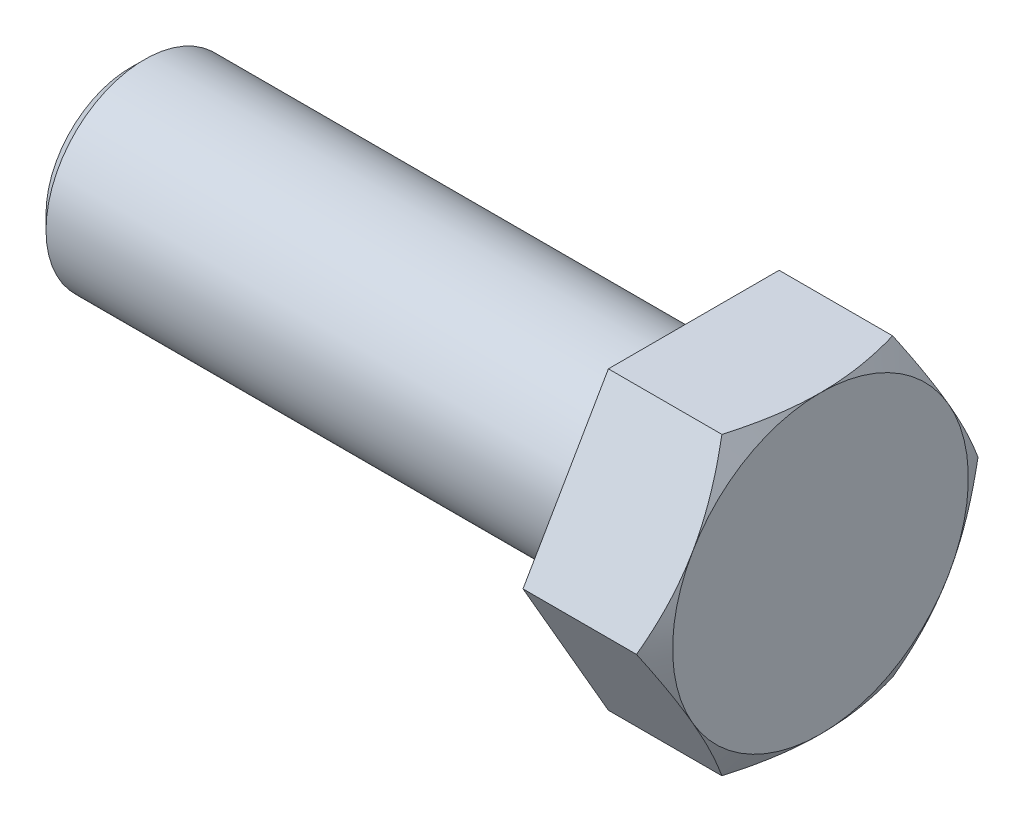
ISO-10303-21;
HEADER;
FILE_DESCRIPTION(('STEP AP214'),'2;1');
FILE_NAME('part.step','',(''),(''),'','','');
FILE_SCHEMA(('AUTOMOTIVE_DESIGN { 1 0 10303 214 1 1 1 1 }'));
ENDSEC;
DATA;
#1=APPLICATION_CONTEXT('core data for automotive mechanical design processes');
#2=APPLICATION_PROTOCOL_DEFINITION('international standard','automotive_design',2000,#1);
#3=PRODUCT_CONTEXT('',#1,'mechanical');
#4=PRODUCT('Part','Part','',(#3));
#5=PRODUCT_RELATED_PRODUCT_CATEGORY('part','',(#4));
#6=PRODUCT_DEFINITION_FORMATION('','',#4);
#7=PRODUCT_DEFINITION_CONTEXT('part definition',#1,'design');
#8=PRODUCT_DEFINITION('design','',#6,#7);
#9=PRODUCT_DEFINITION_SHAPE('','',#8);
#10=(LENGTH_UNIT() NAMED_UNIT(*) SI_UNIT(.MILLI.,.METRE.));
#11=(NAMED_UNIT(*) PLANE_ANGLE_UNIT() SI_UNIT($,.RADIAN.));
#12=(NAMED_UNIT(*) SI_UNIT($,.STERADIAN.) SOLID_ANGLE_UNIT());
#13=UNCERTAINTY_MEASURE_WITH_UNIT(LENGTH_MEASURE(1.E-05),#10,'distance_accuracy_value','');
#14=(GEOMETRIC_REPRESENTATION_CONTEXT(3) GLOBAL_UNCERTAINTY_ASSIGNED_CONTEXT((#13)) GLOBAL_UNIT_ASSIGNED_CONTEXT((#10,
#11,#12)) REPRESENTATION_CONTEXT('',''));
#15=CARTESIAN_POINT('',(0.,0.,0.));
#16=DIRECTION('',(0.,0.,1.));
#17=DIRECTION('',(1.,0.,0.));
#18=AXIS2_PLACEMENT_3D('',#15,#16,#17);
#19=CARTESIAN_POINT('',(0.,-21.,0.));
#20=DIRECTION('',(-1.,0.,0.));
#21=DIRECTION('',(0.,0.,1.));
#22=AXIS2_PLACEMENT_3D('',#19,#20,#21);
#23=PLANE('',#22);
#24=DIRECTION('',(0.,0.866025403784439,-0.499999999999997));
#25=VECTOR('',#24,1.);
#26=CARTESIAN_POINT('',(0.,-10.5,-6.06217782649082));
#27=LINE('',#26,#25);
#28=CARTESIAN_POINT('',(0.,-10.5,-6.06217782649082));
#29=VERTEX_POINT('',#28);
#30=CARTESIAN_POINT('',(0.,0.,-12.1243556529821));
#31=VERTEX_POINT('',#30);
#32=EDGE_CURVE('E207',#29,#31,#27,.T.);
#33=ORIENTED_EDGE('',*,*,#32,.F.);
#34=DIRECTION('',(0.,0.,-1.));
#35=VECTOR('',#34,1.);
#36=CARTESIAN_POINT('',(0.,-10.5,6.06217782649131));
#37=LINE('',#36,#35);
#38=CARTESIAN_POINT('',(0.,-10.5,6.06217782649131));
#39=VERTEX_POINT('',#38);
#40=EDGE_CURVE('E226',#39,#29,#37,.T.);
#41=ORIENTED_EDGE('',*,*,#40,.F.);
#42=DIRECTION('',(0.,-0.866025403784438,-0.500000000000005));
#43=VECTOR('',#42,1.);
#44=CARTESIAN_POINT('',(0.,-1.31838984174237E-13,12.1243556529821));
#45=LINE('',#44,#43);
#46=CARTESIAN_POINT('',(0.,-1.31838984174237E-13,12.1243556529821));
#47=VERTEX_POINT('',#46);
#48=EDGE_CURVE('E223',#47,#39,#45,.T.);
#49=ORIENTED_EDGE('',*,*,#48,.F.);
#50=DIRECTION('',(0.,-0.866025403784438,0.499999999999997));
#51=VECTOR('',#50,1.);
#52=CARTESIAN_POINT('',(0.,10.5,6.06217782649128));
#53=LINE('',#52,#51);
#54=CARTESIAN_POINT('',(0.,10.5,6.06217782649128));
#55=VERTEX_POINT('',#54);
#56=EDGE_CURVE('E221',#55,#47,#53,.T.);
#57=ORIENTED_EDGE('',*,*,#56,.F.);
#58=DIRECTION('',(0.,0.,1.));
#59=VECTOR('',#58,1.);
#60=CARTESIAN_POINT('',(0.,10.5,-6.06217782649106));
#61=LINE('',#60,#59);
#62=CARTESIAN_POINT('',(0.,10.5,-6.06217782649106));
#63=VERTEX_POINT('',#62);
#64=EDGE_CURVE('E218',#63,#55,#61,.T.);
#65=ORIENTED_EDGE('',*,*,#64,.F.);
#66=DIRECTION('',(0.,0.866025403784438,0.500000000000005));
#67=VECTOR('',#66,1.);
#68=CARTESIAN_POINT('',(0.,0.,-12.1243556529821));
#69=LINE('',#68,#67);
#70=EDGE_CURVE('E210',#31,#63,#69,.T.);
#71=ORIENTED_EDGE('',*,*,#70,.F.);
#72=EDGE_LOOP('',(#33,#41,#49,#57,#65,#71));
#73=FACE_BOUND('',#72,.T.);
#74=CARTESIAN_POINT('',(0.,0.,0.));
#75=DIRECTION('',(-1.,0.,0.));
#76=DIRECTION('',(0.,0.,1.));
#77=AXIS2_PLACEMENT_3D('',#74,#75,#76);
#78=CIRCLE('',#77,7.);
#79=CARTESIAN_POINT('',(0.,0.,7.));
#80=VERTEX_POINT('',#79);
#81=EDGE_CURVE('E205',#80,#80,#78,.T.);
#82=ORIENTED_EDGE('',*,*,#81,.F.);
#83=EDGE_LOOP('',(#82));
#84=FACE_BOUND('',#83,.T.);
#85=ADVANCED_FACE('F31',(#73,#84),#23,.T.);
#86=CARTESIAN_POINT('',(9.00000000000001,-10.5,-6.06217782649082));
#87=DIRECTION('',(0.,0.500000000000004,0.866025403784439));
#88=DIRECTION('',(0.,-0.866025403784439,0.499999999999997));
#89=AXIS2_PLACEMENT_3D('',#86,#87,#88);
#90=PLANE('',#89);
#91=DIRECTION('',(-1.,0.,0.));
#92=VECTOR('',#91,1.);
#93=CARTESIAN_POINT('',(8.99999999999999,0.,-12.1243556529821));
#94=LINE('',#93,#92);
#95=CARTESIAN_POINT('',(8.06217782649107,0.,-12.1243556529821));
#96=VERTEX_POINT('',#95);
#97=EDGE_CURVE('E125',#96,#31,#94,.T.);
#98=ORIENTED_EDGE('',*,*,#97,.F.);
#99=CARTESIAN_POINT('',(8.06211115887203,0.000199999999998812,-12.124471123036));
#100=CARTESIAN_POINT('',(8.13903608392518,-0.230612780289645,-11.9912113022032));
#101=CARTESIAN_POINT('',(8.2124696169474,-0.462286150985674,-11.8574546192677));
#102=CARTESIAN_POINT('',(8.3513851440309,-0.927490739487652,-11.5888686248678));
#103=CARTESIAN_POINT('',(8.41686452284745,-1.16102254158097,-11.4540389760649));
#104=CARTESIAN_POINT('',(8.60010423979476,-1.86538084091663,-11.0473775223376));
#105=CARTESIAN_POINT('',(8.70433004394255,-2.33898788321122,-10.7739403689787));
#106=CARTESIAN_POINT('',(8.82654435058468,-3.04771913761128,-10.3647541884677));
#107=CARTESIAN_POINT('',(8.8613585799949,-3.28072597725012,-10.2302276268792));
#108=CARTESIAN_POINT('',(8.91973973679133,-3.7478184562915,-9.96055165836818));
#109=CARTESIAN_POINT('',(8.94330644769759,-3.98190411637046,-9.82540223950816));
#110=CARTESIAN_POINT('',(8.97858873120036,-4.45046590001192,-9.55487796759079));
#111=CARTESIAN_POINT('',(8.99031838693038,-4.68494122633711,-9.41950357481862));
#112=CARTESIAN_POINT('',(9.00167731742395,-5.1541084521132,-9.14862975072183));
#113=CARTESIAN_POINT('',(9.00130696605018,-5.38880034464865,-9.01313032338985));
#114=CARTESIAN_POINT('',(8.98930773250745,-5.82756124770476,-8.75981159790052));
#115=CARTESIAN_POINT('',(8.97914260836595,-6.03166122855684,-8.64197441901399));
#116=CARTESIAN_POINT('',(8.94985839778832,-6.43938384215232,-8.40657565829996));
#117=CARTESIAN_POINT('',(8.93073867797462,-6.64300644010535,-8.28901409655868));
#118=CARTESIAN_POINT('',(8.86039965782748,-7.25308524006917,-7.93678493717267));
#119=CARTESIAN_POINT('',(8.79620926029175,-7.65846156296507,-7.70274080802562));
#120=CARTESIAN_POINT('',(8.63573291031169,-8.4735142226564,-7.23216993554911));
#121=CARTESIAN_POINT('',(8.53876673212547,-8.88308654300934,-6.99570324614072));
#122=CARTESIAN_POINT('',(8.31869386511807,-9.69612354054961,-6.52629611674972));
#123=CARTESIAN_POINT('',(8.19563886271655,-10.0995986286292,-6.29334966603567));
#124=CARTESIAN_POINT('',(8.06211115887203,-10.5002,-6.06206235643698));
#125=B_SPLINE_CURVE_WITH_KNOTS('',3,(#99,#100,#101,#102,#103,#104,#105,#106,#107,#108,#109,#110,
#111,#112,#113,#114,#115,#116,#117,#118,#119,#120,#121,#122,#123,#124),.UNSPECIFIED.,.F.,.F.,(4,
2,2,2,2,2,2,2,2,2,2,2,4),(0.,0.83213025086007,1.66453336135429,3.33288308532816,
4.14658222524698,4.96029702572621,5.77304256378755,6.58576298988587,7.2932670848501,
8.00082123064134,9.41693497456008,10.8644544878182,12.3091325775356),.UNSPECIFIED.);
#126=CARTESIAN_POINT('',(8.99999999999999,-5.25,-9.09326673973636));
#127=VERTEX_POINT('',#126);
#128=EDGE_CURVE('E139',#96,#127,#125,.T.);
#129=ORIENTED_EDGE('',*,*,#128,.T.);
#130=CARTESIAN_POINT('',(8.06217782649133,-10.5,-6.06217782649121));
#131=VERTEX_POINT('',#130);
#132=EDGE_CURVE('E147',#127,#131,#125,.T.);
#133=ORIENTED_EDGE('',*,*,#132,.T.);
#134=DIRECTION('',(-1.,0.,0.));
#135=VECTOR('',#134,1.);
#136=CARTESIAN_POINT('',(9.00000000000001,-10.5,-6.06217782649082));
#137=LINE('',#136,#135);
#138=EDGE_CURVE('E229',#131,#29,#137,.T.);
#139=ORIENTED_EDGE('',*,*,#138,.T.);
#140=ORIENTED_EDGE('',*,*,#32,.T.);
#141=EDGE_LOOP('',(#98,#129,#133,#139,#140));
#142=FACE_BOUND('',#141,.T.);
#143=ADVANCED_FACE('F33',(#142),#90,.F.);
#144=CARTESIAN_POINT('',(8.99999999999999,0.,-12.1243556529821));
#145=DIRECTION('',(0.,-0.499999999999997,0.866025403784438));
#146=DIRECTION('',(0.,-0.866025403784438,-0.500000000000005));
#147=AXIS2_PLACEMENT_3D('',#144,#145,#146);
#148=PLANE('',#147);
#149=DIRECTION('',(-1.,0.,0.));
#150=VECTOR('',#149,1.);
#151=CARTESIAN_POINT('',(9.00000000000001,10.5,-6.06217782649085));
#152=LINE('',#151,#150);
#153=CARTESIAN_POINT('',(8.06217782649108,10.5,-6.06217782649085));
#154=VERTEX_POINT('',#153);
#155=EDGE_CURVE('E236',#154,#63,#152,.T.);
#156=ORIENTED_EDGE('',*,*,#155,.F.);
#157=CARTESIAN_POINT('',(8.06211115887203,10.5002,-6.06206235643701));
#158=CARTESIAN_POINT('',(8.1390360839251,10.2693872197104,-6.19532217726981));
#159=CARTESIAN_POINT('',(8.21246961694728,10.0377138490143,-6.3290788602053));
#160=CARTESIAN_POINT('',(8.35138514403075,9.57250926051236,-6.59766485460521));
#161=CARTESIAN_POINT('',(8.41686452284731,9.33897745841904,-6.73249450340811));
#162=CARTESIAN_POINT('',(8.60010423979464,8.63461915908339,-7.13915595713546));
#163=CARTESIAN_POINT('',(8.70433004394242,8.16101211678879,-7.41259311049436));
#164=CARTESIAN_POINT('',(8.82654435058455,7.45228086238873,-7.82177929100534));
#165=CARTESIAN_POINT('',(8.86135857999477,7.21927402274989,-7.95630585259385));
#166=CARTESIAN_POINT('',(8.9197397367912,6.75218154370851,-8.22598182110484));
#167=CARTESIAN_POINT('',(8.94330644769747,6.51809588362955,-8.36113123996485));
#168=CARTESIAN_POINT('',(8.97858873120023,6.04953409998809,-8.63165551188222));
#169=CARTESIAN_POINT('',(8.99031838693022,5.81505877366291,-8.7670299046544));
#170=CARTESIAN_POINT('',(9.00167731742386,5.34589154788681,-9.03790372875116));
#171=CARTESIAN_POINT('',(9.00130696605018,5.11119965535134,-9.17340315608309));
#172=CARTESIAN_POINT('',(8.98930773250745,4.67243875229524,-9.42672188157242));
#173=CARTESIAN_POINT('',(8.97914260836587,4.46833877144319,-9.54455906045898));
#174=CARTESIAN_POINT('',(8.94985839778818,4.06061615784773,-9.77995782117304));
#175=CARTESIAN_POINT('',(8.93073867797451,3.85699355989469,-9.89751938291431));
#176=CARTESIAN_POINT('',(8.8603996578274,3.24691475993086,-10.2497485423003));
#177=CARTESIAN_POINT('',(8.79620926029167,2.84153843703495,-10.4837926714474));
#178=CARTESIAN_POINT('',(8.6357329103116,2.02648577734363,-10.9543635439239));
#179=CARTESIAN_POINT('',(8.53876673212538,1.61691345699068,-11.1908302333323));
#180=CARTESIAN_POINT('',(8.318693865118,0.803876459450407,-11.6602373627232));
#181=CARTESIAN_POINT('',(8.19563886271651,0.400401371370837,-11.8931838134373));
#182=CARTESIAN_POINT('',(8.06211115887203,-0.000199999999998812,-12.124471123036));
#183=B_SPLINE_CURVE_WITH_KNOTS('',3,(#157,#158,#159,#160,#161,#162,#163,#164,#165,#166,#167,
#168,#169,#170,#171,#172,#173,#174,#175,#176,#177,#178,#179,#180,#181,#182),.UNSPECIFIED.,.F.,
.F.,(4,2,2,2,2,2,2,2,2,2,2,2,4),(0.,0.832130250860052,1.66453336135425,3.33288308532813,
4.14658222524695,4.96029702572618,5.77304256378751,6.58576298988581,7.29326708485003,
8.00082123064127,9.41693497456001,10.8644544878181,12.3091325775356),.UNSPECIFIED.);
#184=CARTESIAN_POINT('',(8.99999999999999,5.24999999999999,-9.09326673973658));
#185=VERTEX_POINT('',#184);
#186=EDGE_CURVE('E114',#154,#185,#183,.T.);
#187=ORIENTED_EDGE('',*,*,#186,.T.);
#188=EDGE_CURVE('E136',#185,#96,#183,.T.);
#189=ORIENTED_EDGE('',*,*,#188,.T.);
#190=ORIENTED_EDGE('',*,*,#97,.T.);
#191=ORIENTED_EDGE('',*,*,#70,.T.);
#192=EDGE_LOOP('',(#156,#187,#189,#190,#191));
#193=FACE_BOUND('',#192,.T.);
#194=ADVANCED_FACE('F251',(#193),#148,.F.);
#195=CARTESIAN_POINT('',(9.00000000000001,10.5,-6.06217782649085));
#196=DIRECTION('',(0.,-1.,0.));
#197=DIRECTION('',(0.,0.,-1.));
#198=AXIS2_PLACEMENT_3D('',#195,#196,#197);
#199=PLANE('',#198);
#200=DIRECTION('',(-1.,0.,0.));
#201=VECTOR('',#200,1.);
#202=CARTESIAN_POINT('',(9.00000000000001,10.5,6.06217782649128));
#203=LINE('',#202,#201);
#204=CARTESIAN_POINT('',(8.06217782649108,10.5,6.06217782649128));
#205=VERTEX_POINT('',#204);
#206=EDGE_CURVE('E234',#205,#55,#203,.T.);
#207=ORIENTED_EDGE('',*,*,#206,.F.);
#208=CARTESIAN_POINT('',(3.73298832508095,10.5,-16.577141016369));
#209=CARTESIAN_POINT('',(3.8454556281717,10.5,-16.3465486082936));
#210=CARTESIAN_POINT('',(3.95738382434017,10.5,-16.1156933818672));
#211=CARTESIAN_POINT('',(4.18004043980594,10.5,-15.6534025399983));
#212=CARTESIAN_POINT('',(4.29076884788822,10.5,-15.4219669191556));
#213=CARTESIAN_POINT('',(4.62099940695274,10.5,-14.726649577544));
#214=CARTESIAN_POINT('',(4.83851565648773,10.5,-14.261821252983));
#215=CARTESIAN_POINT('',(5.2681001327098,10.5,-13.3267584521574));
#216=CARTESIAN_POINT('',(5.48013469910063,10.5,-12.8565084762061));
#217=CARTESIAN_POINT('',(5.89591157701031,10.5,-11.9123694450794));
#218=CARTESIAN_POINT('',(6.09965426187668,10.5,-11.438480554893));
#219=CARTESIAN_POINT('',(6.50344527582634,10.5,-10.4700424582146));
#220=CARTESIAN_POINT('',(6.70312941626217,10.5,-9.97534063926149));
#221=CARTESIAN_POINT('',(7.08808378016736,10.5,-8.98025556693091));
#222=CARTESIAN_POINT('',(7.27335242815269,10.5,-8.47987169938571));
#223=CARTESIAN_POINT('',(7.62482344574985,10.5,-7.47348695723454));
#224=CARTESIAN_POINT('',(7.79106198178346,10.5,-6.96749881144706));
#225=CARTESIAN_POINT('',(8.09934481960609,10.5,-5.94822415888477));
#226=CARTESIAN_POINT('',(8.24139643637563,10.5,-5.43493990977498));
#227=CARTESIAN_POINT('',(8.43095720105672,10.5,-4.66083446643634));
#228=CARTESIAN_POINT('',(8.49008926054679,10.5,-4.40284411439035));
#229=CARTESIAN_POINT('',(8.59983549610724,10.5,-3.88504864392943));
#230=CARTESIAN_POINT('',(8.65044983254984,10.5,-3.62524355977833));
#231=CARTESIAN_POINT('',(8.7422861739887,10.5,-3.10397753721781));
#232=CARTESIAN_POINT('',(8.78350843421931,10.5,-2.84251664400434));
#233=CARTESIAN_POINT('',(8.85575081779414,10.5,-2.31819032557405));
#234=CARTESIAN_POINT('',(8.88677136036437,10.5,-2.05532495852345));
#235=CARTESIAN_POINT('',(8.93758801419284,10.5,-1.53211676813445));
#236=CARTESIAN_POINT('',(8.95753116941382,10.5,-1.27178831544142));
#237=CARTESIAN_POINT('',(8.98637930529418,10.5,-0.750520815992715));
#238=CARTESIAN_POINT('',(8.99528447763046,10.5,-0.489581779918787));
#239=CARTESIAN_POINT('',(9.0018431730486,10.5,0.0324416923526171));
#240=CARTESIAN_POINT('',(8.99949663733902,10.5,0.293526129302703));
#241=CARTESIAN_POINT('',(8.98361221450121,10.5,0.8153569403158));
#242=CARTESIAN_POINT('',(8.97007383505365,10.5,1.07610329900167));
#243=CARTESIAN_POINT('',(8.92502503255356,10.5,1.69398340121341));
#244=CARTESIAN_POINT('',(8.88869314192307,10.5,2.05077383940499));
#245=CARTESIAN_POINT('',(8.79699113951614,10.5,2.76187995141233));
#246=CARTESIAN_POINT('',(8.74161868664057,10.5,3.11619531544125));
#247=CARTESIAN_POINT('',(8.5498626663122,10.5,4.17491630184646));
#248=CARTESIAN_POINT('',(8.38786884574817,10.5,4.8747545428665));
#249=CARTESIAN_POINT('',(8.10469551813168,10.5,5.92182124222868));
#250=CARTESIAN_POINT('',(8.00219294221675,10.5,6.27441462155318));
#251=CARTESIAN_POINT('',(7.78598095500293,10.5,6.97618242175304));
#252=CARTESIAN_POINT('',(7.6722714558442,10.5,7.32535681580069));
#253=CARTESIAN_POINT('',(7.43551618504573,10.4999999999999,8.02038997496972));
#254=CARTESIAN_POINT('',(7.31247296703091,10.4999999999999,8.36624961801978));
#255=CARTESIAN_POINT('',(7.05855378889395,10.5,9.05506244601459));
#256=CARTESIAN_POINT('',(6.92767801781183,10.5,9.39801570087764));
#257=CARTESIAN_POINT('',(6.56118489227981,10.5000000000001,10.3314786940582));
#258=CARTESIAN_POINT('',(6.3190292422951,10.5,10.9194191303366));
#259=CARTESIAN_POINT('',(5.8202069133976,10.4999999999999,12.0891351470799));
#260=CARTESIAN_POINT('',(5.5635385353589,10.4999999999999,12.6709099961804));
#261=CARTESIAN_POINT('',(5.03917038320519,10.4999999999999,13.8297328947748));
#262=CARTESIAN_POINT('',(4.77146619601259,10.4999999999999,14.4067789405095));
#263=CARTESIAN_POINT('',(4.22770202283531,10.4999999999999,15.5568762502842));
#264=CARTESIAN_POINT('',(3.95164239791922,10.4999999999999,16.1299276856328));
#265=CARTESIAN_POINT('',(3.39254290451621,10.4999999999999,17.2737919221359));
#266=CARTESIAN_POINT('',(3.10949216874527,10.4999999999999,17.8445994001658));
#267=CARTESIAN_POINT('',(2.53822148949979,10.4999999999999,18.9836236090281));
#268=CARTESIAN_POINT('',(2.2500015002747,10.4999999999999,19.551840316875));
#269=CARTESIAN_POINT('',(1.66948520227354,10.4999999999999,20.6860208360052));
#270=CARTESIAN_POINT('',(1.37718984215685,10.4999999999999,21.2519851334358));
#271=CARTESIAN_POINT('',(0.789230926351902,10.4999999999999,22.3821571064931));
#272=CARTESIAN_POINT('',(0.493567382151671,10.4999999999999,22.9463647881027));
#273=CARTESIAN_POINT('',(-0.333427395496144,10.4999999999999,24.5151536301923));
#274=CARTESIAN_POINT('',(-0.867767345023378,10.4999999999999,25.5181483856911));
#275=CARTESIAN_POINT('',(-1.94281169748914,10.4999999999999,27.5207974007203));
#276=CARTESIAN_POINT('',(-2.48351651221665,10.4999999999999,28.5204514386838));
#277=CARTESIAN_POINT('',(-3.56778506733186,10.4999999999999,30.5137295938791));
#278=CARTESIAN_POINT('',(-4.1113324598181,10.4999999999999,31.5073626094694));
#279=CARTESIAN_POINT('',(-4.92933439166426,10.4999999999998,32.9962848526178));
#280=CARTESIAN_POINT('',(-5.2024373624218,10.4999999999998,33.49231760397));
#281=CARTESIAN_POINT('',(-5.74944383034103,10.4999999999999,34.4839407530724));
#282=CARTESIAN_POINT('',(-6.02334732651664,10.5,34.9795311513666));
#283=CARTESIAN_POINT('',(-6.29760125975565,10.5000000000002,35.4749275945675));
#284=B_SPLINE_CURVE_WITH_KNOTS('',3,(#208,#209,#210,#211,#212,#213,#214,#215,#216,#217,#218,
#219,#220,#221,#222,#223,#224,#225,#226,#227,#228,#229,#230,#231,#232,#233,#234,#235,#236,#237,
#238,#239,#240,#241,#242,#243,#244,#245,#246,#247,#248,#249,#250,#251,#252,#253,#254,#255,#256,
#257,#258,#259,#260,#261,#262,#263,#264,#265,#266,#267,#268,#269,#270,#271,#272,#273,#274,#275,
#276,#277,#278,#279,#280,#281,#282,#283),.UNSPECIFIED.,.F.,.F.,(4,2,2,2,2,2,2,2,2,2,2,2,2,2,2,2,
2,2,2,2,2,2,2,2,2,2,2,2,2,2,2,2,2,2,2,2,2,4),(0.,0.769671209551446,1.53934960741,
3.07891970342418,4.62638530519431,6.17378115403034,7.77405721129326,9.37450791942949,
10.9718646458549,12.5687374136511,13.3626602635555,14.1565681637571,14.9504544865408,
15.7443081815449,16.5273555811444,17.3103893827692,18.0934272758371,18.876499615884,
19.9518048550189,21.0272423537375,23.1791430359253,24.2806142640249,25.3820941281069,
26.483273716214,27.5844267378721,29.4917019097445,31.3992008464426,33.307470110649,
35.2156570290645,37.1270243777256,39.0384086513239,40.9493551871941,42.8602952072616,
46.2696081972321,49.6791429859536,53.0768896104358,54.7756249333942,56.4743581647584),.UNSPECIFIED.);
#285=CARTESIAN_POINT('',(9.00000000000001,10.5,2.22044604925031E-13));
#286=VERTEX_POINT('',#285);
#287=EDGE_CURVE('E109',#205,#286,#284,.F.);
#288=ORIENTED_EDGE('',*,*,#287,.T.);
#289=EDGE_CURVE('E113',#286,#154,#284,.F.);
#290=ORIENTED_EDGE('',*,*,#289,.T.);
#291=ORIENTED_EDGE('',*,*,#155,.T.);
#292=ORIENTED_EDGE('',*,*,#64,.T.);
#293=EDGE_LOOP('',(#207,#288,#290,#291,#292));
#294=FACE_BOUND('',#293,.T.);
#295=ADVANCED_FACE('F256',(#294),#199,.F.);
#296=CARTESIAN_POINT('',(9.00000000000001,10.5,6.06217782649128));
#297=DIRECTION('',(0.,-0.500000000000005,-0.866025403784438));
#298=DIRECTION('',(0.,0.866025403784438,-0.499999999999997));
#299=AXIS2_PLACEMENT_3D('',#296,#297,#298);
#300=PLANE('',#299);
#301=DIRECTION('',(-1.,0.,0.));
#302=VECTOR('',#301,1.);
#303=CARTESIAN_POINT('',(9.00000000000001,-1.31838984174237E-13,12.1243556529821));
#304=LINE('',#303,#302);
#305=CARTESIAN_POINT('',(8.06217782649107,-1.31838984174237E-13,12.1243556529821));
#306=VERTEX_POINT('',#305);
#307=EDGE_CURVE('E135',#306,#47,#304,.T.);
#308=ORIENTED_EDGE('',*,*,#307,.F.);
#309=CARTESIAN_POINT('',(8.06211115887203,-0.000200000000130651,12.124471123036));
#310=CARTESIAN_POINT('',(8.13903608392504,0.230612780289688,11.9912113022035));
#311=CARTESIAN_POINT('',(8.2124696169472,0.462286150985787,11.8574546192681));
#312=CARTESIAN_POINT('',(8.35138514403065,0.927490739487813,11.5888686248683));
#313=CARTESIAN_POINT('',(8.41686452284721,1.16102254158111,11.4540389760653));
#314=CARTESIAN_POINT('',(8.60010423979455,1.86538084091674,11.0473775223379));
#315=CARTESIAN_POINT('',(8.70433004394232,2.33898788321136,10.773940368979));
#316=CARTESIAN_POINT('',(8.82654435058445,3.04771913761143,10.3647541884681));
#317=CARTESIAN_POINT('',(8.86135857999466,3.28072597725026,10.2302276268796));
#318=CARTESIAN_POINT('',(8.9197397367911,3.74781845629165,9.96055165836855));
#319=CARTESIAN_POINT('',(8.94330644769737,3.9819041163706,9.82540223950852));
#320=CARTESIAN_POINT('',(8.97858873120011,4.45046590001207,9.55487796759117));
#321=CARTESIAN_POINT('',(8.99031838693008,4.68494122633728,9.41950357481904));
#322=CARTESIAN_POINT('',(9.00167731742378,5.15410845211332,9.14862975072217));
#323=CARTESIAN_POINT('',(9.00130696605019,5.3888003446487,9.01313032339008));
#324=CARTESIAN_POINT('',(8.98930773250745,5.8275612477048,8.75981159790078));
#325=CARTESIAN_POINT('',(8.97914260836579,6.03166122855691,8.64197441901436));
#326=CARTESIAN_POINT('',(8.94985839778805,6.43938384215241,8.4065756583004));
#327=CARTESIAN_POINT('',(8.93073867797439,6.64300644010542,8.28901409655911));
#328=CARTESIAN_POINT('',(8.86039965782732,7.25308524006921,7.93678493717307));
#329=CARTESIAN_POINT('',(8.79620926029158,7.65846156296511,7.70274080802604));
#330=CARTESIAN_POINT('',(8.6357329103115,8.47351422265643,7.23216993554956));
#331=CARTESIAN_POINT('',(8.53876673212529,8.88308654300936,6.99570324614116));
#332=CARTESIAN_POINT('',(8.31869386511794,9.69612354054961,6.52629611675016));
#333=CARTESIAN_POINT('',(8.19563886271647,10.0995986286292,6.29334966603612));
#334=CARTESIAN_POINT('',(8.06211115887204,10.5002,6.06206235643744));
#335=B_SPLINE_CURVE_WITH_KNOTS('',3,(#309,#310,#311,#312,#313,#314,#315,#316,#317,#318,#319,
#320,#321,#322,#323,#324,#325,#326,#327,#328,#329,#330,#331,#332,#333,#334),.UNSPECIFIED.,.F.,
.F.,(4,2,2,2,2,2,2,2,2,2,2,2,4),(0.,0.832130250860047,1.66453336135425,3.33288308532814,
4.14658222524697,4.9602970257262,5.77304256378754,6.58576298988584,7.29326708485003,
8.00082123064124,9.41693497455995,10.864454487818,12.3091325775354),.UNSPECIFIED.);
#336=CARTESIAN_POINT('',(9.00000000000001,5.25000000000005,9.09326673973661));
#337=VERTEX_POINT('',#336);
#338=EDGE_CURVE('E116',#306,#337,#335,.T.);
#339=ORIENTED_EDGE('',*,*,#338,.T.);
#340=EDGE_CURVE('E102',#337,#205,#335,.T.);
#341=ORIENTED_EDGE('',*,*,#340,.T.);
#342=ORIENTED_EDGE('',*,*,#206,.T.);
#343=ORIENTED_EDGE('',*,*,#56,.T.);
#344=EDGE_LOOP('',(#308,#339,#341,#342,#343));
#345=FACE_BOUND('',#344,.T.);
#346=ADVANCED_FACE('F133',(#345),#300,.F.);
#347=CARTESIAN_POINT('',(9.00000000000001,-1.31838984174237E-13,12.1243556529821));
#348=DIRECTION('',(0.,0.499999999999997,-0.866025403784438));
#349=DIRECTION('',(0.,0.866025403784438,0.500000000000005));
#350=AXIS2_PLACEMENT_3D('',#347,#348,#349);
#351=PLANE('',#350);
#352=DIRECTION('',(-1.,0.,0.));
#353=VECTOR('',#352,1.);
#354=CARTESIAN_POINT('',(9.00000000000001,-10.5,6.06217782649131));
#355=LINE('',#354,#353);
#356=CARTESIAN_POINT('',(8.06217782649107,-10.5,6.06217782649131));
#357=VERTEX_POINT('',#356);
#358=EDGE_CURVE('E231',#357,#39,#355,.T.);
#359=ORIENTED_EDGE('',*,*,#358,.F.);
#360=CARTESIAN_POINT('',(8.06211115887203,-10.5002,6.06206235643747));
#361=CARTESIAN_POINT('',(8.13903608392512,-10.2693872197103,6.19532217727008));
#362=CARTESIAN_POINT('',(8.2124696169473,-10.0377138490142,6.32907886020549));
#363=CARTESIAN_POINT('',(8.35138514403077,-9.5725092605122,6.59766485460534));
#364=CARTESIAN_POINT('',(8.41686452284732,-9.3389774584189,6.73249450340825));
#365=CARTESIAN_POINT('',(8.60010423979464,-8.63461915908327,7.13915595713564));
#366=CARTESIAN_POINT('',(8.70433004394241,-8.16101211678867,7.41259311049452));
#367=CARTESIAN_POINT('',(8.82654435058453,-7.45228086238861,7.82177929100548));
#368=CARTESIAN_POINT('',(8.86135857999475,-7.21927402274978,7.95630585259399));
#369=CARTESIAN_POINT('',(8.91973973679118,-6.7521815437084,8.22598182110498));
#370=CARTESIAN_POINT('',(8.94330644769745,-6.51809588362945,8.361131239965));
#371=CARTESIAN_POINT('',(8.97858873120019,-6.04953409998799,8.63165551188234));
#372=CARTESIAN_POINT('',(8.99031838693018,-5.81505877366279,8.76702990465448));
#373=CARTESIAN_POINT('',(9.00167731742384,-5.34589154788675,9.03790372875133));
#374=CARTESIAN_POINT('',(9.00130696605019,-5.11119965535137,9.1734031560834));
#375=CARTESIAN_POINT('',(8.98930773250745,-4.67243875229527,9.4267218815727));
#376=CARTESIAN_POINT('',(8.97914260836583,-4.46833877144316,9.54455906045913));
#377=CARTESIAN_POINT('',(8.94985839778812,-4.06061615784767,9.77995782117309));
#378=CARTESIAN_POINT('',(8.93073867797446,-3.85699355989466,9.89751938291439));
#379=CARTESIAN_POINT('',(8.86039965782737,-3.24691475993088,10.2497485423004));
#380=CARTESIAN_POINT('',(8.79620926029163,-2.84153843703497,10.4837926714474));
#381=CARTESIAN_POINT('',(8.63573291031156,-2.02648577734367,10.9543635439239));
#382=CARTESIAN_POINT('',(8.53876673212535,-1.61691345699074,11.1908302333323));
#383=CARTESIAN_POINT('',(8.31869386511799,-0.80387645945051,11.6602373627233));
#384=CARTESIAN_POINT('',(8.1956388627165,-0.400401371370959,11.8931838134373));
#385=CARTESIAN_POINT('',(8.06211115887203,0.000199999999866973,12.124471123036));
#386=B_SPLINE_CURVE_WITH_KNOTS('',3,(#360,#361,#362,#363,#364,#365,#366,#367,#368,#369,#370,
#371,#372,#373,#374,#375,#376,#377,#378,#379,#380,#381,#382,#383,#384,#385),.UNSPECIFIED.,.F.,
.F.,(4,2,2,2,2,2,2,2,2,2,2,2,4),(0.,0.832130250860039,1.66453336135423,3.33288308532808,
4.14658222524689,4.96029702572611,5.77304256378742,6.58576298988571,7.2932670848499,
8.00082123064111,9.41693497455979,10.8644544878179,12.3091325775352),.UNSPECIFIED.);
#387=CARTESIAN_POINT('',(9.00000000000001,-5.25000000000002,9.09326673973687));
#388=VERTEX_POINT('',#387);
#389=EDGE_CURVE('E51',#357,#388,#386,.T.);
#390=ORIENTED_EDGE('',*,*,#389,.T.);
#391=EDGE_CURVE('E122',#388,#306,#386,.T.);
#392=ORIENTED_EDGE('',*,*,#391,.T.);
#393=ORIENTED_EDGE('',*,*,#307,.T.);
#394=ORIENTED_EDGE('',*,*,#48,.T.);
#395=EDGE_LOOP('',(#359,#390,#392,#393,#394));
#396=FACE_BOUND('',#395,.T.);
#397=ADVANCED_FACE('F181',(#396),#351,.F.);
#398=CARTESIAN_POINT('',(9.00000000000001,-10.5,6.06217782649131));
#399=DIRECTION('',(0.,1.,0.));
#400=DIRECTION('',(0.,0.,1.));
#401=AXIS2_PLACEMENT_3D('',#398,#399,#400);
#402=PLANE('',#401);
#403=ORIENTED_EDGE('',*,*,#138,.F.);
#404=CARTESIAN_POINT('',(3.73298833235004,-10.5000000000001,-16.5771410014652));
#405=CARTESIAN_POINT('',(3.8454556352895,-10.5,-16.3465485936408));
#406=CARTESIAN_POINT('',(3.95738383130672,-10.5,-16.1156933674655));
#407=CARTESIAN_POINT('',(4.18004044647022,-10.4999999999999,-15.6534025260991));
#408=CARTESIAN_POINT('',(4.29076885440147,-10.4999999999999,-15.4219669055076));
#409=CARTESIAN_POINT('',(4.6209994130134,-10.5,-14.7266495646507));
#410=CARTESIAN_POINT('',(4.83851566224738,-10.4999999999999,-14.2618212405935));
#411=CARTESIAN_POINT('',(5.26810013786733,-10.4999999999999,-13.3267584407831));
#412=CARTESIAN_POINT('',(5.48013470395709,-10.4999999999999,-12.8565084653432));
#413=CARTESIAN_POINT('',(5.89591158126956,-10.4999999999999,-11.9123694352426));
#414=CARTESIAN_POINT('',(6.09965426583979,-10.4999999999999,-11.438480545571));
#415=CARTESIAN_POINT('',(6.50344527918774,-10.4999999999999,-10.4700424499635));
#416=CARTESIAN_POINT('',(6.7031294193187,-10.4999999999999,-9.97534063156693));
#417=CARTESIAN_POINT('',(7.08808378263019,-10.5,-8.98025556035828));
#418=CARTESIAN_POINT('',(7.2733524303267,-10.5,-8.47987169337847));
#419=CARTESIAN_POINT('',(7.62482344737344,-10.4999999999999,-7.47348695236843));
#420=CARTESIAN_POINT('',(7.79106198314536,-10.4999999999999,-6.96749880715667));
#421=CARTESIAN_POINT('',(8.09934482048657,-10.5,-5.94822415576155));
#422=CARTESIAN_POINT('',(8.24139643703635,-10.5000000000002,-5.4349399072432));
#423=CARTESIAN_POINT('',(8.43095720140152,-10.5000000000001,-4.66083446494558));
#424=CARTESIAN_POINT('',(8.49008926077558,-10.5,-4.40284411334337));
#425=CARTESIAN_POINT('',(8.59983549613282,-10.4999999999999,-3.88504864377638));
#426=CARTESIAN_POINT('',(8.65044983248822,-10.5,-3.62524356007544));
#427=CARTESIAN_POINT('',(8.74228617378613,-10.5,-3.10397753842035));
#428=CARTESIAN_POINT('',(8.78350843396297,-10.5,-2.84251664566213));
#429=CARTESIAN_POINT('',(8.85575081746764,-10.5,-2.31819032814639));
#430=CARTESIAN_POINT('',(8.88677136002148,-10.5,-2.05532496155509));
#431=CARTESIAN_POINT('',(8.93758801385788,-10.5,-1.5321167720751));
#432=CARTESIAN_POINT('',(8.95753116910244,-10.5,-1.27178831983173));
#433=CARTESIAN_POINT('',(8.98637930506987,-10.5,-0.750520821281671));
#434=CARTESIAN_POINT('',(8.99528447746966,-10.5,-0.489581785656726));
#435=CARTESIAN_POINT('',(9.00184317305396,-10.5,0.0324416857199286));
#436=CARTESIAN_POINT('',(8.99949663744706,-10.5,0.293526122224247));
#437=CARTESIAN_POINT('',(8.98361221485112,-10.5,0.815356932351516));
#438=CARTESIAN_POINT('',(8.97007383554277,-10.5,1.07610329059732));
#439=CARTESIAN_POINT('',(8.92502503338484,-10.5,1.69398339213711));
#440=CARTESIAN_POINT('',(8.88869314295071,-10.5,2.05077383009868));
#441=CARTESIAN_POINT('',(8.7969911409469,-10.5,2.76187994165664));
#442=CARTESIAN_POINT('',(8.74161868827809,-10.5,3.11619530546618));
#443=CARTESIAN_POINT('',(8.54986266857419,-10.5,4.17491629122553));
#444=CARTESIAN_POINT('',(8.38786884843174,-10.5,4.87475453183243));
#445=CARTESIAN_POINT('',(8.10469552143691,-10.5,5.92182123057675));
#446=CARTESIAN_POINT('',(8.0021929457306,-10.5,6.27441460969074));
#447=CARTESIAN_POINT('',(7.78598095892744,-10.5,6.97618240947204));
#448=CARTESIAN_POINT('',(7.67227145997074,-10.5,7.32535680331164));
#449=CARTESIAN_POINT('',(7.43551618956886,-10.5,8.02038996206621));
#450=CARTESIAN_POINT('',(7.31247297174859,-10.5,8.36624960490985));
#451=CARTESIAN_POINT('',(7.05855379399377,-10.5,9.05506243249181));
#452=CARTESIAN_POINT('',(6.92767802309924,-10.5,9.39801568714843));
#453=CARTESIAN_POINT('',(6.56118489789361,-10.5,10.3314786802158));
#454=CARTESIAN_POINT('',(6.31902924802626,-10.5,10.9194191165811));
#455=CARTESIAN_POINT('',(5.82020691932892,-10.5,12.0891351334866));
#456=CARTESIAN_POINT('',(5.56353854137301,-10.5,12.6709099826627));
#457=CARTESIAN_POINT('',(5.03917038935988,-10.5,13.8297328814));
#458=CARTESIAN_POINT('',(4.77146620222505,-10.5,14.4067789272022));
#459=CARTESIAN_POINT('',(4.22770202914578,-10.5,15.5568762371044));
#460=CARTESIAN_POINT('',(3.95164240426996,-10.5,16.1299276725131));
#461=CARTESIAN_POINT('',(3.39254291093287,-10.5,17.2737919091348));
#462=CARTESIAN_POINT('',(3.10949217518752,-10.5,17.844599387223));
#463=CARTESIAN_POINT('',(2.53822149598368,-10.5,18.9836235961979));
#464=CARTESIAN_POINT('',(2.25000150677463,-10.5,19.551840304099));
#465=CARTESIAN_POINT('',(1.66948520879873,-10.5,20.6860208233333));
#466=CARTESIAN_POINT('',(1.37718984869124,-10.5,21.2519851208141));
#467=CARTESIAN_POINT('',(0.789230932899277,-10.5000000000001,22.3821570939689));
#468=CARTESIAN_POINT('',(0.493567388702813,-10.5000000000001,22.9463647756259));
#469=CARTESIAN_POINT('',(-0.333427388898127,-10.5000000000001,24.5151536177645));
#470=CARTESIAN_POINT('',(-0.867767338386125,-10.5000000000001,25.5181483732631));
#471=CARTESIAN_POINT('',(-1.94281169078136,-10.5000000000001,27.5207973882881));
#472=CARTESIAN_POINT('',(-2.48351650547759,-10.5000000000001,28.5204514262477));
#473=CARTESIAN_POINT('',(-3.56778506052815,-10.5000000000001,30.5137295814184));
#474=CARTESIAN_POINT('',(-4.11133245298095,-10.5000000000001,31.5073625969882));
#475=CARTESIAN_POINT('',(-4.92933438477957,-10.5000000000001,32.9962848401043));
#476=CARTESIAN_POINT('',(-5.20243735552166,-10.5000000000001,33.4923175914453));
#477=CARTESIAN_POINT('',(-5.74944382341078,-10.5000000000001,34.483940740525));
#478=CARTESIAN_POINT('',(-6.02334731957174,-10.5,34.9795311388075));
#479=CARTESIAN_POINT('',(-6.29760125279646,-10.5,35.4749275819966));
#480=B_SPLINE_CURVE_WITH_KNOTS('',3,(#404,#405,#406,#407,#408,#409,#410,#411,#412,#413,#414,
#415,#416,#417,#418,#419,#420,#421,#422,#423,#424,#425,#426,#427,#428,#429,#430,#431,#432,#433,
#434,#435,#436,#437,#438,#439,#440,#441,#442,#443,#444,#445,#446,#447,#448,#449,#450,#451,#452,
#453,#454,#455,#456,#457,#458,#459,#460,#461,#462,#463,#464,#465,#466,#467,#468,#469,#470,#471,
#472,#473,#474,#475,#476,#477,#478,#479),.UNSPECIFIED.,.F.,.F.,(4,2,2,2,2,2,2,2,2,2,2,2,2,2,2,2,
2,2,2,2,2,2,2,2,2,2,2,2,2,2,2,2,2,2,2,2,2,4),(0.,0.769671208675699,1.5393496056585,
3.07891969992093,4.62638529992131,6.17378114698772,7.7740572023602,9.37450790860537,
10.9718646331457,12.5687373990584,13.3626602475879,14.1565681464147,14.9504544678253,
15.7443081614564,16.5273555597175,17.3103893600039,18.093427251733,18.8764995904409,
19.9518048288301,21.0272423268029,23.1791430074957,24.2806142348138,25.3820940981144,
26.4832736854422,27.5844267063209,29.4917018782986,31.3992008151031,33.3074700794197,
35.2156569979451,37.127024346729,39.0384086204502,40.9493551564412,42.8602951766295,
46.2696081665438,49.6791429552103,53.0768895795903,54.775624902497,56.4743581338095),.UNSPECIFIED.);
#481=CARTESIAN_POINT('',(9.00000000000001,-10.5,2.4980018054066E-13));
#482=VERTEX_POINT('',#481);
#483=EDGE_CURVE('E180',#131,#482,#480,.T.);
#484=ORIENTED_EDGE('',*,*,#483,.T.);
#485=EDGE_CURVE('E130',#482,#357,#480,.T.);
#486=ORIENTED_EDGE('',*,*,#485,.T.);
#487=ORIENTED_EDGE('',*,*,#358,.T.);
#488=ORIENTED_EDGE('',*,*,#40,.T.);
#489=EDGE_LOOP('',(#403,#484,#486,#487,#488));
#490=FACE_BOUND('',#489,.T.);
#491=ADVANCED_FACE('F184',(#490),#402,.F.);
#492=CARTESIAN_POINT('',(-40.,0.,0.));
#493=DIRECTION('',(1.,0.,0.));
#494=DIRECTION('',(0.,0.,-1.));
#495=AXIS2_PLACEMENT_3D('',#492,#493,#494);
#496=CYLINDRICAL_SURFACE('',#495,7.);
#497=CARTESIAN_POINT('',(-39.,0.,0.));
#498=DIRECTION('',(-1.,0.,0.));
#499=DIRECTION('',(0.,0.,1.));
#500=AXIS2_PLACEMENT_3D('',#497,#498,#499);
#501=CIRCLE('',#500,7.);
#502=CARTESIAN_POINT('',(-39.,0.,6.99999999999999));
#503=VERTEX_POINT('',#502);
#504=EDGE_CURVE('E11',#503,#503,#501,.F.);
#505=ORIENTED_EDGE('',*,*,#504,.T.);
#506=EDGE_LOOP('',(#505));
#507=FACE_BOUND('',#506,.T.);
#508=ORIENTED_EDGE('',*,*,#81,.T.);
#509=EDGE_LOOP('',(#508));
#510=FACE_BOUND('',#509,.T.);
#511=ADVANCED_FACE('F189',(#507,#510),#496,.T.);
#512=CARTESIAN_POINT('',(-40.,0.,0.));
#513=DIRECTION('',(-1.,0.,0.));
#514=DIRECTION('',(0.,0.,1.));
#515=AXIS2_PLACEMENT_3D('',#512,#513,#514);
#516=PLANE('',#515);
#517=CARTESIAN_POINT('',(-40.,0.,0.));
#518=DIRECTION('',(-1.,0.,0.));
#519=DIRECTION('',(0.,0.,1.));
#520=AXIS2_PLACEMENT_3D('',#517,#518,#519);
#521=CIRCLE('',#520,5.99999999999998);
#522=CARTESIAN_POINT('',(-40.,0.,5.99999999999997));
#523=VERTEX_POINT('',#522);
#524=EDGE_CURVE('E40',#523,#523,#521,.T.);
#525=ORIENTED_EDGE('',*,*,#524,.T.);
#526=EDGE_LOOP('',(#525));
#527=FACE_BOUND('',#526,.T.);
#528=ADVANCED_FACE('F165',(#527),#516,.T.);
#529=CARTESIAN_POINT('',(9.00000000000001,0.,0.));
#530=DIRECTION('',(-1.,0.,0.));
#531=DIRECTION('',(0.,0.,1.));
#532=AXIS2_PLACEMENT_3D('',#529,#530,#531);
#533=CONICAL_SURFACE('',#532,10.5,1.0471975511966);
#534=ORIENTED_EDGE('',*,*,#391,.F.);
#535=CARTESIAN_POINT('',(9.00000000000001,0.,0.));
#536=DIRECTION('',(-1.,0.,0.));
#537=DIRECTION('',(0.,0.,1.));
#538=AXIS2_PLACEMENT_3D('',#535,#536,#537);
#539=CIRCLE('',#538,10.5);
#540=EDGE_CURVE('E119',#337,#388,#539,.F.);
#541=ORIENTED_EDGE('',*,*,#540,.F.);
#542=ORIENTED_EDGE('',*,*,#338,.F.);
#543=EDGE_LOOP('',(#534,#541,#542));
#544=FACE_BOUND('',#543,.T.);
#545=ADVANCED_FACE('F120',(#544),#533,.T.);
#546=ORIENTED_EDGE('',*,*,#340,.F.);
#547=CARTESIAN_POINT('',(9.00000000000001,0.,0.));
#548=DIRECTION('',(-1.,0.,0.));
#549=DIRECTION('',(0.,0.,1.));
#550=AXIS2_PLACEMENT_3D('',#547,#548,#549);
#551=CIRCLE('',#550,10.5);
#552=EDGE_CURVE('E106',#337,#286,#551,.T.);
#553=ORIENTED_EDGE('',*,*,#552,.T.);
#554=ORIENTED_EDGE('',*,*,#287,.F.);
#555=EDGE_LOOP('',(#546,#553,#554));
#556=FACE_BOUND('',#555,.T.);
#557=ADVANCED_FACE('F104',(#556),#533,.T.);
#558=EDGE_CURVE('E124',#185,#286,#539,.F.);
#559=ORIENTED_EDGE('',*,*,#558,.F.);
#560=ORIENTED_EDGE('',*,*,#186,.F.);
#561=ORIENTED_EDGE('',*,*,#289,.F.);
#562=EDGE_LOOP('',(#559,#560,#561));
#563=FACE_BOUND('',#562,.T.);
#564=ADVANCED_FACE('F162',(#563),#533,.T.);
#565=EDGE_CURVE('E243',#127,#185,#539,.F.);
#566=ORIENTED_EDGE('',*,*,#565,.F.);
#567=ORIENTED_EDGE('',*,*,#128,.F.);
#568=ORIENTED_EDGE('',*,*,#188,.F.);
#569=EDGE_LOOP('',(#566,#567,#568));
#570=FACE_BOUND('',#569,.T.);
#571=ADVANCED_FACE('F268',(#570),#533,.T.);
#572=EDGE_CURVE('E240',#482,#127,#539,.F.);
#573=ORIENTED_EDGE('',*,*,#572,.F.);
#574=ORIENTED_EDGE('',*,*,#483,.F.);
#575=ORIENTED_EDGE('',*,*,#132,.F.);
#576=EDGE_LOOP('',(#573,#574,#575));
#577=FACE_BOUND('',#576,.T.);
#578=ADVANCED_FACE('F265',(#577),#533,.T.);
#579=ORIENTED_EDGE('',*,*,#485,.F.);
#580=EDGE_CURVE('E47',#388,#482,#539,.F.);
#581=ORIENTED_EDGE('',*,*,#580,.F.);
#582=ORIENTED_EDGE('',*,*,#389,.F.);
#583=EDGE_LOOP('',(#579,#581,#582));
#584=FACE_BOUND('',#583,.T.);
#585=ADVANCED_FACE('F163',(#584),#533,.T.);
#586=CARTESIAN_POINT('',(9.00000000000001,-21.,0.));
#587=DIRECTION('',(-1.,0.,0.));
#588=DIRECTION('',(0.,0.,1.));
#589=AXIS2_PLACEMENT_3D('',#586,#587,#588);
#590=PLANE('',#589);
#591=ORIENTED_EDGE('',*,*,#540,.T.);
#592=ORIENTED_EDGE('',*,*,#580,.T.);
#593=ORIENTED_EDGE('',*,*,#572,.T.);
#594=ORIENTED_EDGE('',*,*,#565,.T.);
#595=ORIENTED_EDGE('',*,*,#558,.T.);
#596=ORIENTED_EDGE('',*,*,#552,.F.);
#597=EDGE_LOOP('',(#591,#592,#593,#594,#595,#596));
#598=FACE_BOUND('',#597,.T.);
#599=ADVANCED_FACE('F127',(#598),#590,.F.);
#600=CARTESIAN_POINT('',(-40.,0.,0.));
#601=DIRECTION('',(1.,0.,0.));
#602=DIRECTION('',(0.,0.,-1.));
#603=AXIS2_PLACEMENT_3D('',#600,#601,#602);
#604=CONICAL_SURFACE('',#603,5.99999999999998,0.785398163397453);
#605=ORIENTED_EDGE('',*,*,#504,.F.);
#606=EDGE_LOOP('',(#605));
#607=FACE_BOUND('',#606,.T.);
#608=ORIENTED_EDGE('',*,*,#524,.F.);
#609=EDGE_LOOP('',(#608));
#610=FACE_BOUND('',#609,.T.);
#611=ADVANCED_FACE('F164',(#607,#610),#604,.T.);
#612=CLOSED_SHELL('',(#85,#143,#194,#295,#346,#397,#491,#511,#528,#545,#557,#564,#571,#578,#585,
#599,#611));
#613=MANIFOLD_SOLID_BREP('B2',#612);
#614=ADVANCED_BREP_SHAPE_REPRESENTATION('',(#18,#613),#14);
#615=SHAPE_DEFINITION_REPRESENTATION(#9,#614);
ENDSEC;
END-ISO-10303-21;
